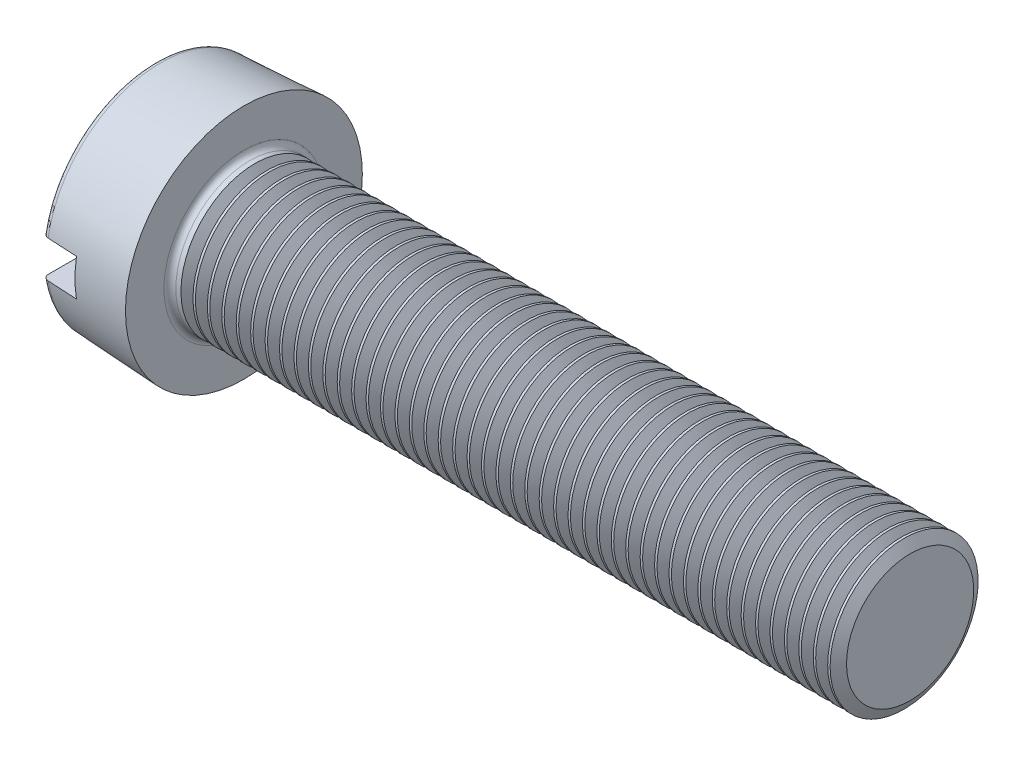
from build123d import *

# Parameters (mm, degrees)
SKETCH2_R        = 8
BASEHEAD_DEPTH   = 6
BASEHEAD_DRAFT   = -3
SKETCH3_R        = 5
BASEBODY_DEPTH   = 45
SLOT_DEPTH       = 55.409741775
SLOT_DEPTH_BACK  = 55.409741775
SKETCH4_W        = 2.5
SKETCH4_H        = 2.4
HEADFILLET_R     = 0.4
LPATTERN10_COUNT = 46
LPATTERN10_PITCH = 0.9744


with BuildPart() as part:
    # Sketch2 → BaseHead (with draft: the straight prism first)
    with BuildSketch(Plane(origin=(6, 0, 0), x_dir=(0, 0, -1), z_dir=(1, 0, 0))):
        Circle(SKETCH2_R)
    extrude(amount=-BASEHEAD_DEPTH)
    # BaseHead: the draft: its side faces are tilted about the plane it starts from
    basehead_sides = [part.faces().sort_by_distance(p)[0] for p in [
        (3, 0, 8),
    ]]
    draft(basehead_sides, Plane(origin=(6, 0, 0), x_dir=(0, 0, -1), z_dir=(1, 0, 0)), BASEHEAD_DRAFT)

    # Sketch3 → BaseBody (add)
    with BuildSketch(Plane(origin=(6, -1.110095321, -1.354392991), x_dir=(0, 0, -1), z_dir=(1, 0, 0))):
        with Locations(Location((-1.354392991, 1.110095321, 0), (0, 0, 180))):
            Circle(SKETCH3_R)
    extrude(amount=BASEBODY_DEPTH)

    # Sketch4 → Slot (cut, two sides: drawn at the far end of the back side and taken through both)
    with BuildSketch(Plane(origin=(-1.9, -1.9, 0), x_dir=(0, 1, 0), z_dir=(0, 0, 1)).offset(-SLOT_DEPTH_BACK)):
        with Locations((1.9, -3.1)):
            Rectangle(SKETCH4_W, SKETCH4_H)
    extrude(amount=SLOT_DEPTH + SLOT_DEPTH_BACK, mode=Mode.SUBTRACT)

    # HeadFillet
    headfillet_edges = [part.edges().sort_by_distance(p)[0] for p in [
        (6, 0, -5),
        (0, -7.685553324, 0),
        (0, 7.685553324, 0),
    ]]
    fillet(headfillet_edges, radius=HEADFILLET_R)

    # Sketch5 → Cut-Revolve10 (revolve, cut)
    with BuildSketch(Plane.XY, mode=Mode.PRIVATE) as cut_revolve10_sk:
        Polygon((51.406, 5), (51.406, 5.812), (50.594, 5.812), (50.594, 5), (51, 4.296787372), align=None)
    cut_revolve10 = revolve(cut_revolve10_sk.sketch.rotate(Axis((0, 0, 0), (1, 0, 0)), 90), axis=Axis((0, 0, 0), (1, 0, 0)), mode=Mode.SUBTRACT)

    # LPattern10: Cut-Revolve10 ×46
    with Locations(*[(-i * LPATTERN10_PITCH, 0, 0) for i in range(1, LPATTERN10_COUNT)]):
        add(cut_revolve10, mode=Mode.SUBTRACT)


solid = part.part
